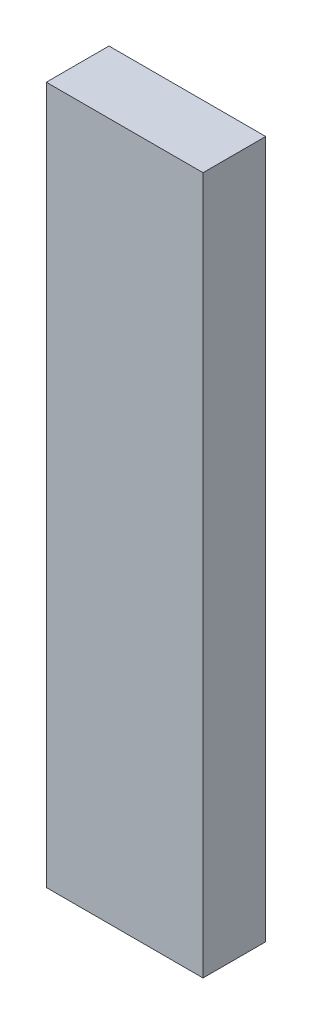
ISO-10303-21;
HEADER;
FILE_DESCRIPTION(('STEP AP214'),'2;1');
FILE_NAME('part.step','',(''),(''),'','','');
FILE_SCHEMA(('AUTOMOTIVE_DESIGN { 1 0 10303 214 1 1 1 1 }'));
ENDSEC;
DATA;
#1=APPLICATION_CONTEXT('core data for automotive mechanical design processes');
#2=APPLICATION_PROTOCOL_DEFINITION('international standard','automotive_design',2000,#1);
#3=PRODUCT_CONTEXT('',#1,'mechanical');
#4=PRODUCT('Part','Part','',(#3));
#5=PRODUCT_RELATED_PRODUCT_CATEGORY('part','',(#4));
#6=PRODUCT_DEFINITION_FORMATION('','',#4);
#7=PRODUCT_DEFINITION_CONTEXT('part definition',#1,'design');
#8=PRODUCT_DEFINITION('design','',#6,#7);
#9=PRODUCT_DEFINITION_SHAPE('','',#8);
#10=(LENGTH_UNIT() NAMED_UNIT(*) SI_UNIT(.MILLI.,.METRE.));
#11=(NAMED_UNIT(*) PLANE_ANGLE_UNIT() SI_UNIT($,.RADIAN.));
#12=(NAMED_UNIT(*) SI_UNIT($,.STERADIAN.) SOLID_ANGLE_UNIT());
#13=UNCERTAINTY_MEASURE_WITH_UNIT(LENGTH_MEASURE(1.E-05),#10,'distance_accuracy_value','');
#14=(GEOMETRIC_REPRESENTATION_CONTEXT(3) GLOBAL_UNCERTAINTY_ASSIGNED_CONTEXT((#13)) GLOBAL_UNIT_ASSIGNED_CONTEXT((#10,
#11,#12)) REPRESENTATION_CONTEXT('',''));
#15=CARTESIAN_POINT('',(0.,0.,0.));
#16=DIRECTION('',(0.,0.,1.));
#17=DIRECTION('',(1.,0.,0.));
#18=AXIS2_PLACEMENT_3D('',#15,#16,#17);
#19=CARTESIAN_POINT('',(0.,0.,8.));
#20=DIRECTION('',(1.,0.,0.));
#21=DIRECTION('',(0.,0.,-1.));
#22=AXIS2_PLACEMENT_3D('',#19,#20,#21);
#23=PLANE('',#22);
#24=DIRECTION('',(0.,-1.,0.));
#25=VECTOR('',#24,1.);
#26=CARTESIAN_POINT('',(0.,0.,0.));
#27=LINE('',#26,#25);
#28=CARTESIAN_POINT('',(0.,89.,0.));
#29=VERTEX_POINT('',#28);
#30=CARTESIAN_POINT('',(0.,0.,0.));
#31=VERTEX_POINT('',#30);
#32=EDGE_CURVE('E94',#29,#31,#27,.T.);
#33=ORIENTED_EDGE('',*,*,#32,.T.);
#34=DIRECTION('',(0.,0.,-1.));
#35=VECTOR('',#34,1.);
#36=CARTESIAN_POINT('',(0.,0.,8.));
#37=LINE('',#36,#35);
#38=CARTESIAN_POINT('',(0.,0.,8.));
#39=VERTEX_POINT('',#38);
#40=EDGE_CURVE('E11',#39,#31,#37,.T.);
#41=ORIENTED_EDGE('',*,*,#40,.F.);
#42=DIRECTION('',(0.,-1.,0.));
#43=VECTOR('',#42,1.);
#44=CARTESIAN_POINT('',(0.,0.,8.));
#45=LINE('',#44,#43);
#46=CARTESIAN_POINT('',(0.,89.,8.));
#47=VERTEX_POINT('',#46);
#48=EDGE_CURVE('E82',#47,#39,#45,.T.);
#49=ORIENTED_EDGE('',*,*,#48,.F.);
#50=DIRECTION('',(0.,0.,-1.));
#51=VECTOR('',#50,1.);
#52=CARTESIAN_POINT('',(0.,89.,8.));
#53=LINE('',#52,#51);
#54=EDGE_CURVE('E90',#47,#29,#53,.T.);
#55=ORIENTED_EDGE('',*,*,#54,.T.);
#56=EDGE_LOOP('',(#33,#41,#49,#55));
#57=FACE_BOUND('',#56,.T.);
#58=ADVANCED_FACE('F31',(#57),#23,.F.);
#59=CARTESIAN_POINT('',(0.,0.,8.));
#60=DIRECTION('',(0.,1.,0.));
#61=DIRECTION('',(0.,0.,1.));
#62=AXIS2_PLACEMENT_3D('',#59,#60,#61);
#63=PLANE('',#62);
#64=DIRECTION('',(1.,0.,0.));
#65=VECTOR('',#64,1.);
#66=CARTESIAN_POINT('',(0.,0.,0.));
#67=LINE('',#66,#65);
#68=CARTESIAN_POINT('',(20.,0.,0.));
#69=VERTEX_POINT('',#68);
#70=EDGE_CURVE('E86',#31,#69,#67,.T.);
#71=ORIENTED_EDGE('',*,*,#70,.T.);
#72=DIRECTION('',(0.,0.,-1.));
#73=VECTOR('',#72,1.);
#74=CARTESIAN_POINT('',(20.,0.,8.));
#75=LINE('',#74,#73);
#76=CARTESIAN_POINT('',(20.,0.,8.));
#77=VERTEX_POINT('',#76);
#78=EDGE_CURVE('E39',#77,#69,#75,.T.);
#79=ORIENTED_EDGE('',*,*,#78,.F.);
#80=DIRECTION('',(1.,0.,0.));
#81=VECTOR('',#80,1.);
#82=CARTESIAN_POINT('',(0.,0.,8.));
#83=LINE('',#82,#81);
#84=EDGE_CURVE('E77',#39,#77,#83,.T.);
#85=ORIENTED_EDGE('',*,*,#84,.F.);
#86=ORIENTED_EDGE('',*,*,#40,.T.);
#87=EDGE_LOOP('',(#71,#79,#85,#86));
#88=FACE_BOUND('',#87,.T.);
#89=ADVANCED_FACE('F85',(#88),#63,.F.);
#90=CARTESIAN_POINT('',(20.,0.,8.));
#91=DIRECTION('',(-1.,0.,0.));
#92=DIRECTION('',(0.,0.,1.));
#93=AXIS2_PLACEMENT_3D('',#90,#91,#92);
#94=PLANE('',#93);
#95=DIRECTION('',(0.,1.,0.));
#96=VECTOR('',#95,1.);
#97=CARTESIAN_POINT('',(20.,0.,0.));
#98=LINE('',#97,#96);
#99=CARTESIAN_POINT('',(20.,89.,0.));
#100=VERTEX_POINT('',#99);
#101=EDGE_CURVE('E64',#69,#100,#98,.T.);
#102=ORIENTED_EDGE('',*,*,#101,.T.);
#103=DIRECTION('',(0.,0.,-1.));
#104=VECTOR('',#103,1.);
#105=CARTESIAN_POINT('',(20.,89.,8.));
#106=LINE('',#105,#104);
#107=CARTESIAN_POINT('',(20.,89.,8.));
#108=VERTEX_POINT('',#107);
#109=EDGE_CURVE('E87',#108,#100,#106,.T.);
#110=ORIENTED_EDGE('',*,*,#109,.F.);
#111=DIRECTION('',(0.,1.,0.));
#112=VECTOR('',#111,1.);
#113=CARTESIAN_POINT('',(20.,0.,8.));
#114=LINE('',#113,#112);
#115=EDGE_CURVE('E80',#77,#108,#114,.T.);
#116=ORIENTED_EDGE('',*,*,#115,.F.);
#117=ORIENTED_EDGE('',*,*,#78,.T.);
#118=EDGE_LOOP('',(#102,#110,#116,#117));
#119=FACE_BOUND('',#118,.T.);
#120=ADVANCED_FACE('F88',(#119),#94,.F.);
#121=CARTESIAN_POINT('',(0.,89.,8.));
#122=DIRECTION('',(0.,-1.,0.));
#123=DIRECTION('',(0.,0.,-1.));
#124=AXIS2_PLACEMENT_3D('',#121,#122,#123);
#125=PLANE('',#124);
#126=DIRECTION('',(-1.,0.,0.));
#127=VECTOR('',#126,1.);
#128=CARTESIAN_POINT('',(0.,89.,0.));
#129=LINE('',#128,#127);
#130=EDGE_CURVE('E70',#100,#29,#129,.T.);
#131=ORIENTED_EDGE('',*,*,#130,.T.);
#132=ORIENTED_EDGE('',*,*,#54,.F.);
#133=DIRECTION('',(-1.,0.,0.));
#134=VECTOR('',#133,1.);
#135=CARTESIAN_POINT('',(0.,89.,8.));
#136=LINE('',#135,#134);
#137=EDGE_CURVE('E47',#108,#47,#136,.T.);
#138=ORIENTED_EDGE('',*,*,#137,.F.);
#139=ORIENTED_EDGE('',*,*,#109,.T.);
#140=EDGE_LOOP('',(#131,#132,#138,#139));
#141=FACE_BOUND('',#140,.T.);
#142=ADVANCED_FACE('F101',(#141),#125,.F.);
#143=CARTESIAN_POINT('',(0.,89.,8.));
#144=DIRECTION('',(0.,0.,-1.));
#145=DIRECTION('',(-1.,0.,0.));
#146=AXIS2_PLACEMENT_3D('',#143,#144,#145);
#147=PLANE('',#146);
#148=ORIENTED_EDGE('',*,*,#48,.T.);
#149=ORIENTED_EDGE('',*,*,#84,.T.);
#150=ORIENTED_EDGE('',*,*,#115,.T.);
#151=ORIENTED_EDGE('',*,*,#137,.T.);
#152=EDGE_LOOP('',(#148,#149,#150,#151));
#153=FACE_BOUND('',#152,.T.);
#154=ADVANCED_FACE('F78',(#153),#147,.F.);
#155=CARTESIAN_POINT('',(0.,89.,0.));
#156=DIRECTION('',(0.,0.,-1.));
#157=DIRECTION('',(-1.,0.,0.));
#158=AXIS2_PLACEMENT_3D('',#155,#156,#157);
#159=PLANE('',#158);
#160=ORIENTED_EDGE('',*,*,#32,.F.);
#161=ORIENTED_EDGE('',*,*,#130,.F.);
#162=ORIENTED_EDGE('',*,*,#101,.F.);
#163=ORIENTED_EDGE('',*,*,#70,.F.);
#164=EDGE_LOOP('',(#160,#161,#162,#163));
#165=FACE_BOUND('',#164,.T.);
#166=ADVANCED_FACE('F104',(#165),#159,.T.);
#167=CLOSED_SHELL('',(#58,#89,#120,#142,#154,#166));
#168=MANIFOLD_SOLID_BREP('B2',#167);
#169=ADVANCED_BREP_SHAPE_REPRESENTATION('',(#18,#168),#14);
#170=SHAPE_DEFINITION_REPRESENTATION(#9,#169);
ENDSEC;
END-ISO-10303-21;
